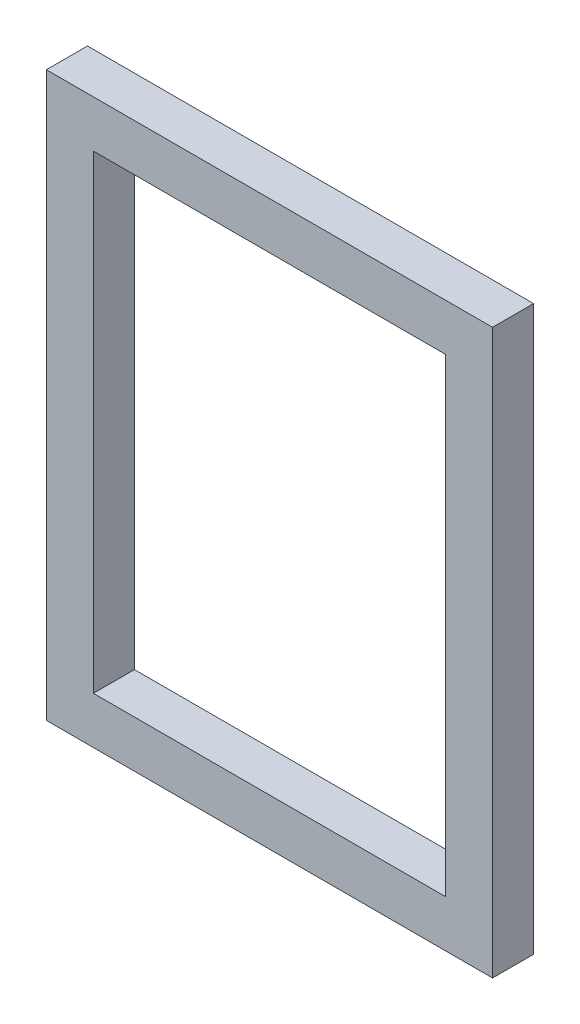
from build123d import *

# Parameters (mm, degrees)
SKIZZE2_W = 40
SKIZZE2_H = 35


with BuildPart() as part:
    # Austragung1: sweep along a path in Skizze1
    with BuildLine(Plane.XY) as austragung1_path:
        Line((300, 1400), (600, 1400))
        Line((600, 1400), (600, 1000))
        Line((600, 1000), (300, 1000))
        Line((300, 1000), (300, 1400))
    # Skizze2 → Austragung1 (sweep)
    with BuildSketch(Plane(origin=(300, 1000, 0), x_dir=(1, 0, 0), z_dir=(0, -1, 0))):
        with Locations((-20, 17.5)):
            Rectangle(SKIZZE2_W, SKIZZE2_H)
    sweep(path=austragung1_path.line, transition=Transition.RIGHT)


solid = part.part
